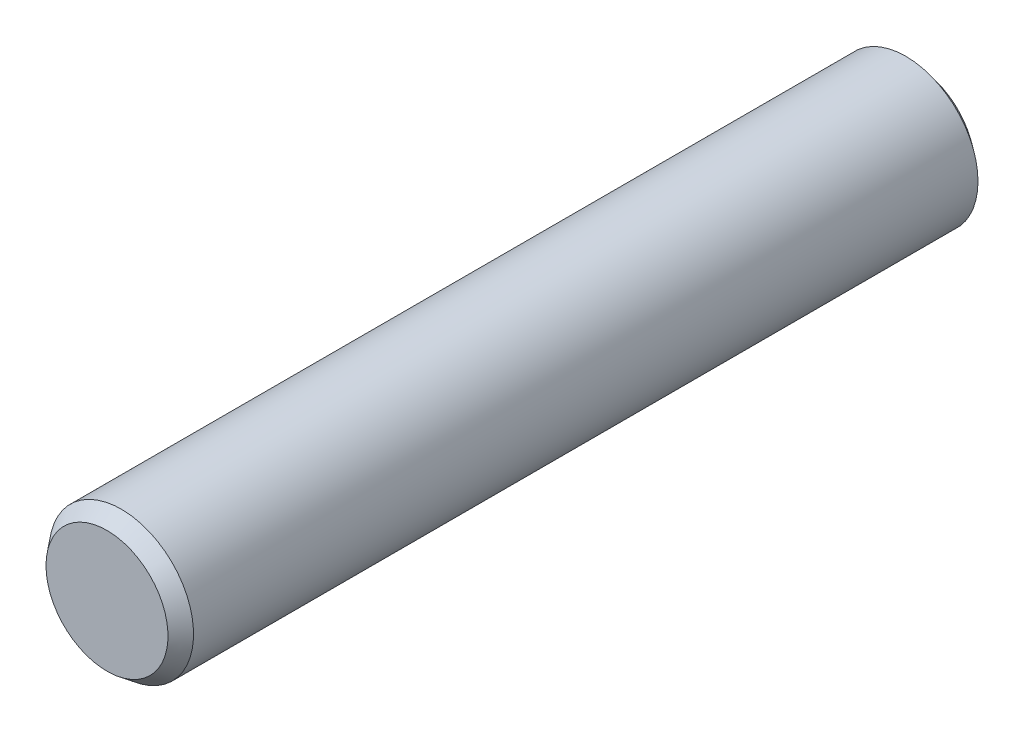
from build123d import *
from OCP.BRepFilletAPI import BRepFilletAPI_MakeChamfer

# Parameters (mm, degrees)
SKETCH1_R           = 3.9624
BOSS_EXTRUDE1_DEPTH = 44.45
CHAMFER1_SIZE       = 0.7874
CHAMFER1_SIZE2      = 0.615184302


with BuildPart() as part:
    # Sketch1 → Boss-Extrude1 (new body)
    with BuildSketch(Plane.XY):
        Circle(SKETCH1_R)
    extrude(amount=BOSS_EXTRUDE1_DEPTH)

    # Chamfer1: one chamfer whose edges measure the first distance from different faces: ONE call of the kernel's chamfer builder (chamfer() names one face for all edges)
    chamfer1_edges_1 = [part.edges().sort_by_distance(p)[0] for p in [
        (-3.9624, 0, 0),
    ]]
    chamfer1_side_1 = [part.faces().sort_by_distance(p)[0] for p in [
        (0, 0, 0),
    ]]
    chamfer1_edges_2 = [part.edges().sort_by_distance(p)[0] for p in [
        (-3.9624, 0, 44.45),
    ]]
    chamfer1_side_2 = [part.faces().sort_by_distance(p)[0] for p in [
        (-3.9624, 0, 22.225),
    ]]
    chamfer1 = BRepFilletAPI_MakeChamfer(part.part.solid().wrapped)
    for e in chamfer1_edges_1:
        chamfer1.Add(CHAMFER1_SIZE, CHAMFER1_SIZE2, e.wrapped, chamfer1_side_1[0].wrapped)  # the first distance lies on this face
    for e in chamfer1_edges_2:
        chamfer1.Add(CHAMFER1_SIZE, CHAMFER1_SIZE2, e.wrapped, chamfer1_side_2[0].wrapped)  # the first distance lies on this face
    add(Compound.cast(chamfer1.Shape()), mode=Mode.REPLACE)


solid = part.part
